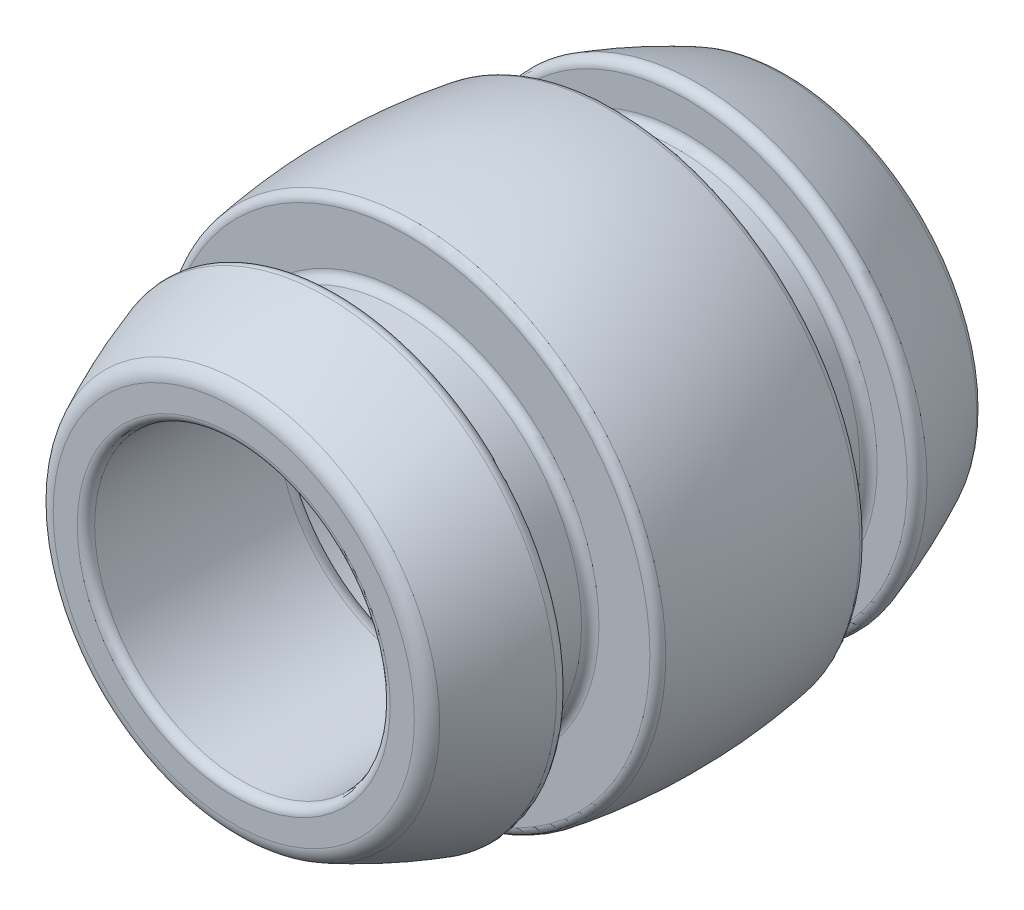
ISO-10303-21;
HEADER;
FILE_DESCRIPTION(('STEP AP214'),'2;1');
FILE_NAME('part.step','',(''),(''),'','','');
FILE_SCHEMA(('AUTOMOTIVE_DESIGN { 1 0 10303 214 1 1 1 1 }'));
ENDSEC;
DATA;
#1=APPLICATION_CONTEXT('core data for automotive mechanical design processes');
#2=APPLICATION_PROTOCOL_DEFINITION('international standard','automotive_design',2000,#1);
#3=PRODUCT_CONTEXT('',#1,'mechanical');
#4=PRODUCT('Part','Part','',(#3));
#5=PRODUCT_RELATED_PRODUCT_CATEGORY('part','',(#4));
#6=PRODUCT_DEFINITION_FORMATION('','',#4);
#7=PRODUCT_DEFINITION_CONTEXT('part definition',#1,'design');
#8=PRODUCT_DEFINITION('design','',#6,#7);
#9=PRODUCT_DEFINITION_SHAPE('','',#8);
#10=(LENGTH_UNIT() NAMED_UNIT(*) SI_UNIT(.MILLI.,.METRE.));
#11=(NAMED_UNIT(*) PLANE_ANGLE_UNIT() SI_UNIT($,.RADIAN.));
#12=(NAMED_UNIT(*) SI_UNIT($,.STERADIAN.) SOLID_ANGLE_UNIT());
#13=UNCERTAINTY_MEASURE_WITH_UNIT(LENGTH_MEASURE(1.E-05),#10,'distance_accuracy_value','');
#14=(GEOMETRIC_REPRESENTATION_CONTEXT(3) GLOBAL_UNCERTAINTY_ASSIGNED_CONTEXT((#13)) GLOBAL_UNIT_ASSIGNED_CONTEXT((#10,
#11,#12)) REPRESENTATION_CONTEXT('',''));
#15=CARTESIAN_POINT('',(0.,0.,0.));
#16=DIRECTION('',(0.,0.,1.));
#17=DIRECTION('',(1.,0.,0.));
#18=AXIS2_PLACEMENT_3D('',#15,#16,#17);
#19=CARTESIAN_POINT('',(0.,0.,-28.5));
#20=DIRECTION('',(0.,0.,1.));
#21=DIRECTION('',(1.,0.,0.));
#22=AXIS2_PLACEMENT_3D('',#19,#20,#21);
#23=PLANE('',#22);
#24=CARTESIAN_POINT('',(0.,0.,-28.5));
#25=DIRECTION('',(0.,0.,-1.));
#26=DIRECTION('',(-1.,0.,0.));
#27=AXIS2_PLACEMENT_3D('',#24,#25,#26);
#28=CIRCLE('',#27,8.);
#29=CARTESIAN_POINT('',(8.,0.,-28.5));
#30=VERTEX_POINT('',#29);
#31=CARTESIAN_POINT('',(-8.,0.,-28.5));
#32=VERTEX_POINT('',#31);
#33=EDGE_CURVE('E132',#30,#32,#28,.F.);
#34=ORIENTED_EDGE('',*,*,#33,.T.);
#35=CARTESIAN_POINT('',(0.,0.,-28.5));
#36=DIRECTION('',(0.,0.,-1.));
#37=DIRECTION('',(1.,0.,0.));
#38=AXIS2_PLACEMENT_3D('',#35,#36,#37);
#39=CIRCLE('',#38,8.);
#40=EDGE_CURVE('E129',#32,#30,#39,.F.);
#41=ORIENTED_EDGE('',*,*,#40,.T.);
#42=EDGE_LOOP('',(#34,#41));
#43=FACE_BOUND('',#42,.T.);
#44=ADVANCED_FACE('F17',(#43),#23,.T.);
#45=CARTESIAN_POINT('',(0.,0.,-28.));
#46=DIRECTION('',(0.,0.,1.));
#47=DIRECTION('',(1.,0.,0.));
#48=AXIS2_PLACEMENT_3D('',#45,#46,#47);
#49=TOROIDAL_SURFACE('',#48,8.,0.5);
#50=ORIENTED_EDGE('',*,*,#33,.F.);
#51=ORIENTED_EDGE('',*,*,#40,.F.);
#52=EDGE_LOOP('',(#50,#51));
#53=FACE_BOUND('',#52,.T.);
#54=CARTESIAN_POINT('',(0.,0.,-28.));
#55=DIRECTION('',(0.,0.,1.));
#56=DIRECTION('',(1.,0.,0.));
#57=AXIS2_PLACEMENT_3D('',#54,#55,#56);
#58=CIRCLE('',#57,8.5);
#59=CARTESIAN_POINT('',(8.5,0.,-28.));
#60=VERTEX_POINT('',#59);
#61=EDGE_CURVE('E136',#60,#60,#58,.T.);
#62=ORIENTED_EDGE('',*,*,#61,.T.);
#63=EDGE_LOOP('',(#62));
#64=FACE_BOUND('',#63,.T.);
#65=ADVANCED_FACE('F139',(#53,#64),#49,.F.);
#66=CARTESIAN_POINT('',(0.,0.,-56.0416305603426));
#67=DIRECTION('',(0.,0.,1.));
#68=DIRECTION('',(1.,0.,0.));
#69=AXIS2_PLACEMENT_3D('',#66,#67,#68);
#70=CYLINDRICAL_SURFACE('',#69,8.5);
#71=ORIENTED_EDGE('',*,*,#61,.F.);
#72=EDGE_LOOP('',(#71));
#73=FACE_BOUND('',#72,.T.);
#74=CARTESIAN_POINT('',(0.,0.,-21.));
#75=DIRECTION('',(0.,0.,1.));
#76=DIRECTION('',(1.,0.,0.));
#77=AXIS2_PLACEMENT_3D('',#74,#75,#76);
#78=CIRCLE('',#77,8.5);
#79=CARTESIAN_POINT('',(8.5,0.,-21.));
#80=VERTEX_POINT('',#79);
#81=EDGE_CURVE('E178',#80,#80,#78,.F.);
#82=ORIENTED_EDGE('',*,*,#81,.F.);
#83=EDGE_LOOP('',(#82));
#84=FACE_BOUND('',#83,.T.);
#85=ADVANCED_FACE('F159',(#73,#84),#70,.F.);
#86=CARTESIAN_POINT('',(0.,0.,-21.));
#87=DIRECTION('',(0.,0.,1.));
#88=DIRECTION('',(1.,0.,0.));
#89=AXIS2_PLACEMENT_3D('',#86,#87,#88);
#90=TOROIDAL_SURFACE('',#89,9.5,1.);
#91=ORIENTED_EDGE('',*,*,#81,.T.);
#92=EDGE_LOOP('',(#91));
#93=FACE_BOUND('',#92,.T.);
#94=CARTESIAN_POINT('',(0.,0.,-20.));
#95=DIRECTION('',(0.,0.,1.));
#96=DIRECTION('',(1.,0.,0.));
#97=AXIS2_PLACEMENT_3D('',#94,#95,#96);
#98=CIRCLE('',#97,9.5);
#99=CARTESIAN_POINT('',(-9.5,0.,-20.));
#100=VERTEX_POINT('',#99);
#101=CARTESIAN_POINT('',(9.5,0.,-20.));
#102=VERTEX_POINT('',#101);
#103=EDGE_CURVE('E173',#100,#102,#98,.F.);
#104=ORIENTED_EDGE('',*,*,#103,.F.);
#105=CARTESIAN_POINT('',(0.,0.,-20.));
#106=DIRECTION('',(0.,0.,1.));
#107=DIRECTION('',(-1.,0.,0.));
#108=AXIS2_PLACEMENT_3D('',#105,#106,#107);
#109=CIRCLE('',#108,9.5);
#110=EDGE_CURVE('E186',#102,#100,#109,.F.);
#111=ORIENTED_EDGE('',*,*,#110,.F.);
#112=EDGE_LOOP('',(#104,#111));
#113=FACE_BOUND('',#112,.T.);
#114=ADVANCED_FACE('F147',(#93,#113),#90,.T.);
#115=CARTESIAN_POINT('',(0.,12.,-20.));
#116=DIRECTION('',(0.,0.,1.));
#117=DIRECTION('',(1.,0.,0.));
#118=AXIS2_PLACEMENT_3D('',#115,#116,#117);
#119=PLANE('',#118);
#120=CARTESIAN_POINT('',(0.,0.,-20.));
#121=DIRECTION('',(0.,0.,-1.));
#122=DIRECTION('',(-1.,0.,0.));
#123=AXIS2_PLACEMENT_3D('',#120,#121,#122);
#124=CIRCLE('',#123,11.);
#125=CARTESIAN_POINT('',(11.,0.,-20.));
#126=VERTEX_POINT('',#125);
#127=CARTESIAN_POINT('',(-11.,0.,-20.));
#128=VERTEX_POINT('',#127);
#129=EDGE_CURVE('E815',#126,#128,#124,.F.);
#130=ORIENTED_EDGE('',*,*,#129,.T.);
#131=CARTESIAN_POINT('',(0.,0.,-20.));
#132=DIRECTION('',(0.,0.,-1.));
#133=DIRECTION('',(1.,0.,0.));
#134=AXIS2_PLACEMENT_3D('',#131,#132,#133);
#135=CIRCLE('',#134,11.);
#136=EDGE_CURVE('E836',#128,#126,#135,.F.);
#137=ORIENTED_EDGE('',*,*,#136,.T.);
#138=EDGE_LOOP('',(#130,#137));
#139=FACE_BOUND('',#138,.T.);
#140=ORIENTED_EDGE('',*,*,#110,.T.);
#141=ORIENTED_EDGE('',*,*,#103,.T.);
#142=EDGE_LOOP('',(#140,#141));
#143=FACE_BOUND('',#142,.T.);
#144=ADVANCED_FACE('F158',(#139,#143),#119,.T.);
#145=CARTESIAN_POINT('',(0.,0.,-19.));
#146=DIRECTION('',(0.,0.,1.));
#147=DIRECTION('',(1.,0.,0.));
#148=AXIS2_PLACEMENT_3D('',#145,#146,#147);
#149=TOROIDAL_SURFACE('',#148,11.,1.);
#150=CARTESIAN_POINT('',(0.,0.,-19.));
#151=DIRECTION('',(0.,0.,1.));
#152=DIRECTION('',(1.,0.,0.));
#153=AXIS2_PLACEMENT_3D('',#150,#151,#152);
#154=CIRCLE('',#153,12.);
#155=CARTESIAN_POINT('',(12.,0.,-19.));
#156=VERTEX_POINT('',#155);
#157=EDGE_CURVE('E833',#156,#156,#154,.T.);
#158=ORIENTED_EDGE('',*,*,#157,.T.);
#159=EDGE_LOOP('',(#158));
#160=FACE_BOUND('',#159,.T.);
#161=ORIENTED_EDGE('',*,*,#136,.F.);
#162=ORIENTED_EDGE('',*,*,#129,.F.);
#163=EDGE_LOOP('',(#161,#162));
#164=FACE_BOUND('',#163,.T.);
#165=ADVANCED_FACE('F819',(#160,#164),#149,.F.);
#166=CARTESIAN_POINT('',(0.,0.,10.1838755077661));
#167=DIRECTION('',(0.,0.,1.));
#168=DIRECTION('',(1.,0.,0.));
#169=AXIS2_PLACEMENT_3D('',#166,#167,#168);
#170=CYLINDRICAL_SURFACE('',#169,12.);
#171=CARTESIAN_POINT('',(0.,0.,-13.));
#172=DIRECTION('',(0.,0.,-1.));
#173=DIRECTION('',(-1.,0.,0.));
#174=AXIS2_PLACEMENT_3D('',#171,#172,#173);
#175=CIRCLE('',#174,12.);
#176=CARTESIAN_POINT('',(-12.,0.,-13.));
#177=VERTEX_POINT('',#176);
#178=EDGE_CURVE('E832',#177,#177,#175,.F.);
#179=ORIENTED_EDGE('',*,*,#178,.T.);
#180=EDGE_LOOP('',(#179));
#181=FACE_BOUND('',#180,.T.);
#182=ORIENTED_EDGE('',*,*,#157,.F.);
#183=EDGE_LOOP('',(#182));
#184=FACE_BOUND('',#183,.T.);
#185=ADVANCED_FACE('F799',(#181,#184),#170,.F.);
#186=CARTESIAN_POINT('',(0.,0.,-13.));
#187=DIRECTION('',(0.,0.,-1.));
#188=DIRECTION('',(-1.,0.,0.));
#189=AXIS2_PLACEMENT_3D('',#186,#187,#188);
#190=TOROIDAL_SURFACE('',#189,11.,1.);
#191=ORIENTED_EDGE('',*,*,#178,.F.);
#192=EDGE_LOOP('',(#191));
#193=FACE_BOUND('',#192,.T.);
#194=CARTESIAN_POINT('',(0.,0.,-12.));
#195=DIRECTION('',(0.,0.,1.));
#196=DIRECTION('',(-1.,0.,0.));
#197=AXIS2_PLACEMENT_3D('',#194,#195,#196);
#198=CIRCLE('',#197,11.);
#199=CARTESIAN_POINT('',(11.,0.,-12.));
#200=VERTEX_POINT('',#199);
#201=CARTESIAN_POINT('',(-11.,0.,-12.));
#202=VERTEX_POINT('',#201);
#203=EDGE_CURVE('E755',#200,#202,#198,.F.);
#204=ORIENTED_EDGE('',*,*,#203,.F.);
#205=CARTESIAN_POINT('',(0.,0.,-12.));
#206=DIRECTION('',(0.,0.,1.));
#207=DIRECTION('',(1.,0.,0.));
#208=AXIS2_PLACEMENT_3D('',#205,#206,#207);
#209=CIRCLE('',#208,11.);
#210=EDGE_CURVE('E745',#202,#200,#209,.F.);
#211=ORIENTED_EDGE('',*,*,#210,.F.);
#212=EDGE_LOOP('',(#204,#211));
#213=FACE_BOUND('',#212,.T.);
#214=ADVANCED_FACE('F795',(#193,#213),#190,.F.);
#215=CARTESIAN_POINT('',(0.,12.,-12.));
#216=DIRECTION('',(0.,0.,-1.));
#217=DIRECTION('',(-1.,0.,0.));
#218=AXIS2_PLACEMENT_3D('',#215,#216,#217);
#219=PLANE('',#218);
#220=CARTESIAN_POINT('',(0.,0.,-12.));
#221=DIRECTION('',(0.,0.,-1.));
#222=DIRECTION('',(1.,0.,0.));
#223=AXIS2_PLACEMENT_3D('',#220,#221,#222);
#224=CIRCLE('',#223,9.5);
#225=CARTESIAN_POINT('',(9.5,0.,-12.));
#226=VERTEX_POINT('',#225);
#227=CARTESIAN_POINT('',(-9.5,0.,-12.));
#228=VERTEX_POINT('',#227);
#229=EDGE_CURVE('E716',#226,#228,#224,.T.);
#230=ORIENTED_EDGE('',*,*,#229,.F.);
#231=CARTESIAN_POINT('',(0.,0.,-12.));
#232=DIRECTION('',(0.,0.,-1.));
#233=DIRECTION('',(-1.,0.,0.));
#234=AXIS2_PLACEMENT_3D('',#231,#232,#233);
#235=CIRCLE('',#234,9.5);
#236=EDGE_CURVE('E775',#228,#226,#235,.T.);
#237=ORIENTED_EDGE('',*,*,#236,.F.);
#238=EDGE_LOOP('',(#230,#237));
#239=FACE_BOUND('',#238,.T.);
#240=ORIENTED_EDGE('',*,*,#210,.T.);
#241=ORIENTED_EDGE('',*,*,#203,.T.);
#242=EDGE_LOOP('',(#240,#241));
#243=FACE_BOUND('',#242,.T.);
#244=ADVANCED_FACE('F731',(#239,#243),#219,.T.);
#245=CARTESIAN_POINT('',(0.,0.,-11.));
#246=DIRECTION('',(0.,0.,-1.));
#247=DIRECTION('',(-1.,0.,0.));
#248=AXIS2_PLACEMENT_3D('',#245,#246,#247);
#249=TOROIDAL_SURFACE('',#248,9.5,1.);
#250=CARTESIAN_POINT('',(0.,0.,-11.));
#251=DIRECTION('',(0.,0.,1.));
#252=DIRECTION('',(1.,0.,0.));
#253=AXIS2_PLACEMENT_3D('',#250,#251,#252);
#254=CIRCLE('',#253,8.5);
#255=CARTESIAN_POINT('',(8.5,0.,-11.));
#256=VERTEX_POINT('',#255);
#257=EDGE_CURVE('E740',#256,#256,#254,.T.);
#258=ORIENTED_EDGE('',*,*,#257,.T.);
#259=EDGE_LOOP('',(#258));
#260=FACE_BOUND('',#259,.T.);
#261=ORIENTED_EDGE('',*,*,#236,.T.);
#262=ORIENTED_EDGE('',*,*,#229,.T.);
#263=EDGE_LOOP('',(#261,#262));
#264=FACE_BOUND('',#263,.T.);
#265=ADVANCED_FACE('F721',(#260,#264),#249,.T.);
#266=CARTESIAN_POINT('',(0.,0.,-56.0416305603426));
#267=DIRECTION('',(0.,0.,1.));
#268=DIRECTION('',(1.,0.,0.));
#269=AXIS2_PLACEMENT_3D('',#266,#267,#268);
#270=CYLINDRICAL_SURFACE('',#269,8.5);
#271=ORIENTED_EDGE('',*,*,#257,.F.);
#272=EDGE_LOOP('',(#271));
#273=FACE_BOUND('',#272,.T.);
#274=CARTESIAN_POINT('',(0.,0.,-0.5));
#275=DIRECTION('',(0.,0.,-1.));
#276=DIRECTION('',(-1.,0.,0.));
#277=AXIS2_PLACEMENT_3D('',#274,#275,#276);
#278=CIRCLE('',#277,8.5);
#279=CARTESIAN_POINT('',(-8.5,0.,-0.5));
#280=VERTEX_POINT('',#279);
#281=EDGE_CURVE('E1152',#280,#280,#278,.T.);
#282=ORIENTED_EDGE('',*,*,#281,.F.);
#283=EDGE_LOOP('',(#282));
#284=FACE_BOUND('',#283,.T.);
#285=ADVANCED_FACE('F695',(#273,#284),#270,.F.);
#286=CARTESIAN_POINT('',(0.,0.,-0.5));
#287=DIRECTION('',(0.,0.,-1.));
#288=DIRECTION('',(-1.,0.,0.));
#289=AXIS2_PLACEMENT_3D('',#286,#287,#288);
#290=TOROIDAL_SURFACE('',#289,9.,0.5);
#291=CARTESIAN_POINT('',(0.,0.,0.));
#292=DIRECTION('',(0.,0.,1.));
#293=DIRECTION('',(-1.,0.,0.));
#294=AXIS2_PLACEMENT_3D('',#291,#292,#293);
#295=CIRCLE('',#294,9.);
#296=CARTESIAN_POINT('',(-9.,0.,0.));
#297=VERTEX_POINT('',#296);
#298=CARTESIAN_POINT('',(9.,0.,0.));
#299=VERTEX_POINT('',#298);
#300=EDGE_CURVE('E605',#297,#299,#295,.T.);
#301=ORIENTED_EDGE('',*,*,#300,.T.);
#302=CARTESIAN_POINT('',(0.,0.,0.));
#303=DIRECTION('',(0.,0.,1.));
#304=DIRECTION('',(1.,0.,0.));
#305=AXIS2_PLACEMENT_3D('',#302,#303,#304);
#306=CIRCLE('',#305,9.);
#307=EDGE_CURVE('E1157',#299,#297,#306,.T.);
#308=ORIENTED_EDGE('',*,*,#307,.T.);
#309=EDGE_LOOP('',(#301,#308));
#310=FACE_BOUND('',#309,.T.);
#311=ORIENTED_EDGE('',*,*,#281,.T.);
#312=EDGE_LOOP('',(#311));
#313=FACE_BOUND('',#312,.T.);
#314=ADVANCED_FACE('F691',(#310,#313),#290,.T.);
#315=CARTESIAN_POINT('',(0.,0.,-32.));
#316=DIRECTION('',(0.,0.,1.));
#317=DIRECTION('',(1.,0.,0.));
#318=AXIS2_PLACEMENT_3D('',#315,#316,#317);
#319=PLANE('',#318);
#320=CARTESIAN_POINT('',(0.,0.,-32.));
#321=DIRECTION('',(0.,0.,1.));
#322=DIRECTION('',(1.,0.,0.));
#323=AXIS2_PLACEMENT_3D('',#320,#321,#322);
#324=CIRCLE('',#323,10.383527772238);
#325=CARTESIAN_POINT('',(10.383527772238,0.,-32.));
#326=VERTEX_POINT('',#325);
#327=CARTESIAN_POINT('',(-10.383527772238,0.,-32.));
#328=VERTEX_POINT('',#327);
#329=EDGE_CURVE('E658',#326,#328,#324,.T.);
#330=ORIENTED_EDGE('',*,*,#329,.F.);
#331=CARTESIAN_POINT('',(0.,0.,-32.));
#332=DIRECTION('',(0.,0.,1.));
#333=DIRECTION('',(-1.,0.,0.));
#334=AXIS2_PLACEMENT_3D('',#331,#332,#333);
#335=CIRCLE('',#334,10.383527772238);
#336=EDGE_CURVE('E669',#328,#326,#335,.T.);
#337=ORIENTED_EDGE('',*,*,#336,.F.);
#338=EDGE_LOOP('',(#330,#337));
#339=FACE_BOUND('',#338,.T.);
#340=ADVANCED_FACE('F619',(#339),#319,.F.);
#341=CARTESIAN_POINT('',(0.,0.,0.));
#342=DIRECTION('',(0.,0.,-1.));
#343=DIRECTION('',(-1.,0.,0.));
#344=AXIS2_PLACEMENT_3D('',#341,#342,#343);
#345=PLANE('',#344);
#346=CARTESIAN_POINT('',(0.,0.,0.));
#347=DIRECTION('',(0.,0.,-1.));
#348=DIRECTION('',(-1.,0.,0.));
#349=AXIS2_PLACEMENT_3D('',#346,#347,#348);
#350=CIRCLE('',#349,10.383527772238);
#351=CARTESIAN_POINT('',(-10.383527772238,0.,0.));
#352=VERTEX_POINT('',#351);
#353=CARTESIAN_POINT('',(10.383527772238,0.,0.));
#354=VERTEX_POINT('',#353);
#355=EDGE_CURVE('E563',#352,#354,#350,.T.);
#356=ORIENTED_EDGE('',*,*,#355,.F.);
#357=CARTESIAN_POINT('',(0.,0.,0.));
#358=DIRECTION('',(0.,0.,-1.));
#359=DIRECTION('',(1.,0.,0.));
#360=AXIS2_PLACEMENT_3D('',#357,#358,#359);
#361=CIRCLE('',#360,10.383527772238);
#362=EDGE_CURVE('E598',#354,#352,#361,.T.);
#363=ORIENTED_EDGE('',*,*,#362,.F.);
#364=EDGE_LOOP('',(#356,#363));
#365=FACE_BOUND('',#364,.T.);
#366=ORIENTED_EDGE('',*,*,#300,.F.);
#367=ORIENTED_EDGE('',*,*,#307,.F.);
#368=EDGE_LOOP('',(#366,#367));
#369=FACE_BOUND('',#368,.T.);
#370=ADVANCED_FACE('F610',(#365,#369),#345,.F.);
#371=CARTESIAN_POINT('',(0.,0.,-31.));
#372=DIRECTION('',(0.,0.,1.));
#373=DIRECTION('',(1.,0.,0.));
#374=AXIS2_PLACEMENT_3D('',#371,#372,#373);
#375=TOROIDAL_SURFACE('',#374,10.383527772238,1.);
#376=ORIENTED_EDGE('',*,*,#329,.T.);
#377=ORIENTED_EDGE('',*,*,#336,.T.);
#378=EDGE_LOOP('',(#376,#377));
#379=FACE_BOUND('',#378,.T.);
#380=CARTESIAN_POINT('',(0.,0.,-31.4411764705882));
#381=DIRECTION('',(0.,0.,1.));
#382=DIRECTION('',(1.,0.,0.));
#383=AXIS2_PLACEMENT_3D('',#380,#381,#382);
#384=CIRCLE('',#383,11.2809481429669);
#385=CARTESIAN_POINT('',(11.2809481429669,0.,-31.4411764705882));
#386=VERTEX_POINT('',#385);
#387=EDGE_CURVE('E596',#386,#386,#384,.T.);
#388=ORIENTED_EDGE('',*,*,#387,.F.);
#389=EDGE_LOOP('',(#388));
#390=FACE_BOUND('',#389,.T.);
#391=ADVANCED_FACE('F582',(#379,#390),#375,.T.);
#392=CARTESIAN_POINT('',(0.,0.,-0.999999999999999));
#393=DIRECTION('',(0.,0.,-1.));
#394=DIRECTION('',(-1.,0.,0.));
#395=AXIS2_PLACEMENT_3D('',#392,#393,#394);
#396=TOROIDAL_SURFACE('',#395,10.383527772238,1.);
#397=ORIENTED_EDGE('',*,*,#355,.T.);
#398=ORIENTED_EDGE('',*,*,#362,.T.);
#399=EDGE_LOOP('',(#397,#398));
#400=FACE_BOUND('',#399,.T.);
#401=CARTESIAN_POINT('',(0.,0.,-0.558823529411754));
#402=DIRECTION('',(0.,0.,1.));
#403=DIRECTION('',(1.,0.,0.));
#404=AXIS2_PLACEMENT_3D('',#401,#402,#403);
#405=CIRCLE('',#404,11.2809481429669);
#406=CARTESIAN_POINT('',(11.2809481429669,0.,-0.558823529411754));
#407=VERTEX_POINT('',#406);
#408=EDGE_CURVE('E593',#407,#407,#405,.F.);
#409=ORIENTED_EDGE('',*,*,#408,.F.);
#410=EDGE_LOOP('',(#409));
#411=FACE_BOUND('',#410,.T.);
#412=ADVANCED_FACE('F570',(#400,#411),#396,.T.);
#413=CARTESIAN_POINT('',(-20.1287648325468,0.,-16.));
#414=DIRECTION('',(0.,1.,0.));
#415=DIRECTION('',(1.,0.,0.));
#416=AXIS2_PLACEMENT_3D('',#413,#414,#415);
#417=CIRCLE('',#416,35.);
#418=TRIMMED_CURVE('',#417,(PARAMETER_VALUE(-0.958060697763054)),
(PARAMETER_VALUE(0.958060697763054)),.T.,.PARAMETER.);
#419=CARTESIAN_POINT('',(0.,0.,-16.));
#420=DIRECTION('',(0.,0.,1.));
#421=AXIS1_PLACEMENT('',#419,#420);
#422=SURFACE_OF_REVOLUTION('',#418,#421);
#423=ORIENTED_EDGE('',*,*,#387,.T.);
#424=EDGE_LOOP('',(#423));
#425=FACE_BOUND('',#424,.T.);
#426=CARTESIAN_POINT('',(0.,0.,-26.6521739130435));
#427=DIRECTION('',(0.,0.,-1.));
#428=DIRECTION('',(-1.,0.,0.));
#429=AXIS2_PLACEMENT_3D('',#426,#427,#428);
#430=CIRCLE('',#429,13.2108691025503);
#431=CARTESIAN_POINT('',(-13.2108691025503,0.,-26.6521739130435));
#432=VERTEX_POINT('',#431);
#433=EDGE_CURVE('E592',#432,#432,#430,.F.);
#434=ORIENTED_EDGE('',*,*,#433,.F.);
#435=EDGE_LOOP('',(#434));
#436=FACE_BOUND('',#435,.T.);
#437=ADVANCED_FACE('F581',(#425,#436),#422,.F.);
#438=CARTESIAN_POINT('',(-20.1287648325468,0.,-16.));
#439=DIRECTION('',(0.,1.,0.));
#440=DIRECTION('',(1.,0.,0.));
#441=AXIS2_PLACEMENT_3D('',#438,#439,#440);
#442=CIRCLE('',#441,35.);
#443=TRIMMED_CURVE('',#442,(PARAMETER_VALUE(-0.958060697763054)),
(PARAMETER_VALUE(0.958060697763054)),.T.,.PARAMETER.);
#444=CARTESIAN_POINT('',(0.,0.,-16.));
#445=DIRECTION('',(0.,0.,1.));
#446=AXIS1_PLACEMENT('',#444,#445);
#447=SURFACE_OF_REVOLUTION('',#443,#446);
#448=CARTESIAN_POINT('',(0.,0.,-5.34782608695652));
#449=DIRECTION('',(0.,0.,1.));
#450=DIRECTION('',(1.,0.,0.));
#451=AXIS2_PLACEMENT_3D('',#448,#449,#450);
#452=CIRCLE('',#451,13.2108691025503);
#453=CARTESIAN_POINT('',(13.2108691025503,0.,-5.34782608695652));
#454=VERTEX_POINT('',#453);
#455=EDGE_CURVE('E1164',#454,#454,#452,.F.);
#456=ORIENTED_EDGE('',*,*,#455,.F.);
#457=EDGE_LOOP('',(#456));
#458=FACE_BOUND('',#457,.T.);
#459=ORIENTED_EDGE('',*,*,#408,.T.);
#460=EDGE_LOOP('',(#459));
#461=FACE_BOUND('',#460,.T.);
#462=ADVANCED_FACE('F1015',(#458,#461),#447,.F.);
#463=CARTESIAN_POINT('',(0.,0.,-26.5));
#464=DIRECTION('',(0.,0.,-1.));
#465=DIRECTION('',(-1.,0.,0.));
#466=AXIS2_PLACEMENT_3D('',#463,#464,#465);
#467=TOROIDAL_SURFACE('',#466,12.7345886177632,0.5);
#468=CARTESIAN_POINT('',(0.,0.,-26.));
#469=DIRECTION('',(0.,0.,-1.));
#470=DIRECTION('',(-1.,0.,0.));
#471=AXIS2_PLACEMENT_3D('',#468,#469,#470);
#472=CIRCLE('',#471,12.7345886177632);
#473=CARTESIAN_POINT('',(-12.7345886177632,0.,-26.));
#474=VERTEX_POINT('',#473);
#475=CARTESIAN_POINT('',(12.7345886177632,0.,-26.));
#476=VERTEX_POINT('',#475);
#477=EDGE_CURVE('E474',#474,#476,#472,.T.);
#478=ORIENTED_EDGE('',*,*,#477,.T.);
#479=CARTESIAN_POINT('',(0.,0.,-26.));
#480=DIRECTION('',(0.,0.,-1.));
#481=DIRECTION('',(1.,0.,0.));
#482=AXIS2_PLACEMENT_3D('',#479,#480,#481);
#483=CIRCLE('',#482,12.7345886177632);
#484=EDGE_CURVE('E484',#476,#474,#483,.T.);
#485=ORIENTED_EDGE('',*,*,#484,.T.);
#486=EDGE_LOOP('',(#478,#485));
#487=FACE_BOUND('',#486,.T.);
#488=ORIENTED_EDGE('',*,*,#433,.T.);
#489=EDGE_LOOP('',(#488));
#490=FACE_BOUND('',#489,.T.);
#491=ADVANCED_FACE('F532',(#487,#490),#467,.T.);
#492=CARTESIAN_POINT('',(0.,0.,-5.5));
#493=DIRECTION('',(0.,0.,1.));
#494=DIRECTION('',(1.,0.,0.));
#495=AXIS2_PLACEMENT_3D('',#492,#493,#494);
#496=TOROIDAL_SURFACE('',#495,12.7345886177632,0.5);
#497=CARTESIAN_POINT('',(0.,0.,-6.));
#498=DIRECTION('',(0.,0.,1.));
#499=DIRECTION('',(1.,0.,0.));
#500=AXIS2_PLACEMENT_3D('',#497,#498,#499);
#501=CIRCLE('',#500,12.7345886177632);
#502=CARTESIAN_POINT('',(12.7345886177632,0.,-6.));
#503=VERTEX_POINT('',#502);
#504=CARTESIAN_POINT('',(-12.7345886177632,0.,-6.));
#505=VERTEX_POINT('',#504);
#506=EDGE_CURVE('E1182',#503,#505,#501,.T.);
#507=ORIENTED_EDGE('',*,*,#506,.T.);
#508=CARTESIAN_POINT('',(0.,0.,-6.));
#509=DIRECTION('',(0.,0.,1.));
#510=DIRECTION('',(-1.,0.,0.));
#511=AXIS2_PLACEMENT_3D('',#508,#509,#510);
#512=CIRCLE('',#511,12.7345886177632);
#513=EDGE_CURVE('E453',#505,#503,#512,.T.);
#514=ORIENTED_EDGE('',*,*,#513,.T.);
#515=EDGE_LOOP('',(#507,#514));
#516=FACE_BOUND('',#515,.T.);
#517=ORIENTED_EDGE('',*,*,#455,.T.);
#518=EDGE_LOOP('',(#517));
#519=FACE_BOUND('',#518,.T.);
#520=ADVANCED_FACE('F528',(#516,#519),#496,.T.);
#521=CARTESIAN_POINT('',(10.5,0.,-26.));
#522=DIRECTION('',(0.,0.,-1.));
#523=DIRECTION('',(-1.,0.,0.));
#524=AXIS2_PLACEMENT_3D('',#521,#522,#523);
#525=PLANE('',#524);
#526=CARTESIAN_POINT('',(0.,0.,-26.));
#527=DIRECTION('',(0.,0.,1.));
#528=DIRECTION('',(-1.,0.,0.));
#529=AXIS2_PLACEMENT_3D('',#526,#527,#528);
#530=CIRCLE('',#529,11.);
#531=CARTESIAN_POINT('',(11.,0.,-26.));
#532=VERTEX_POINT('',#531);
#533=CARTESIAN_POINT('',(-11.,0.,-26.));
#534=VERTEX_POINT('',#533);
#535=EDGE_CURVE('E495',#532,#534,#530,.F.);
#536=ORIENTED_EDGE('',*,*,#535,.T.);
#537=CARTESIAN_POINT('',(0.,0.,-26.));
#538=DIRECTION('',(0.,0.,1.));
#539=DIRECTION('',(1.,0.,0.));
#540=AXIS2_PLACEMENT_3D('',#537,#538,#539);
#541=CIRCLE('',#540,11.);
#542=EDGE_CURVE('E506',#534,#532,#541,.F.);
#543=ORIENTED_EDGE('',*,*,#542,.T.);
#544=EDGE_LOOP('',(#536,#543));
#545=FACE_BOUND('',#544,.T.);
#546=ORIENTED_EDGE('',*,*,#477,.F.);
#547=ORIENTED_EDGE('',*,*,#484,.F.);
#548=EDGE_LOOP('',(#546,#547));
#549=FACE_BOUND('',#548,.T.);
#550=ADVANCED_FACE('F431',(#545,#549),#525,.F.);
#551=CARTESIAN_POINT('',(10.5,0.,-6.));
#552=DIRECTION('',(0.,0.,1.));
#553=DIRECTION('',(1.,0.,0.));
#554=AXIS2_PLACEMENT_3D('',#551,#552,#553);
#555=PLANE('',#554);
#556=ORIENTED_EDGE('',*,*,#506,.F.);
#557=ORIENTED_EDGE('',*,*,#513,.F.);
#558=EDGE_LOOP('',(#556,#557));
#559=FACE_BOUND('',#558,.T.);
#560=CARTESIAN_POINT('',(0.,0.,-6.));
#561=DIRECTION('',(0.,0.,-1.));
#562=DIRECTION('',(1.,0.,0.));
#563=AXIS2_PLACEMENT_3D('',#560,#561,#562);
#564=CIRCLE('',#563,11.);
#565=CARTESIAN_POINT('',(-11.,0.,-6.));
#566=VERTEX_POINT('',#565);
#567=CARTESIAN_POINT('',(11.,0.,-6.));
#568=VERTEX_POINT('',#567);
#569=EDGE_CURVE('E381',#566,#568,#564,.F.);
#570=ORIENTED_EDGE('',*,*,#569,.T.);
#571=CARTESIAN_POINT('',(0.,0.,-6.));
#572=DIRECTION('',(0.,0.,-1.));
#573=DIRECTION('',(-1.,0.,0.));
#574=AXIS2_PLACEMENT_3D('',#571,#572,#573);
#575=CIRCLE('',#574,11.);
#576=EDGE_CURVE('E413',#568,#566,#575,.F.);
#577=ORIENTED_EDGE('',*,*,#576,.T.);
#578=EDGE_LOOP('',(#570,#577));
#579=FACE_BOUND('',#578,.T.);
#580=ADVANCED_FACE('F422',(#559,#579),#555,.F.);
#581=CARTESIAN_POINT('',(0.,0.,-25.5));
#582=DIRECTION('',(0.,0.,-1.));
#583=DIRECTION('',(-1.,0.,0.));
#584=AXIS2_PLACEMENT_3D('',#581,#582,#583);
#585=TOROIDAL_SURFACE('',#584,11.,0.5);
#586=ORIENTED_EDGE('',*,*,#542,.F.);
#587=ORIENTED_EDGE('',*,*,#535,.F.);
#588=EDGE_LOOP('',(#586,#587));
#589=FACE_BOUND('',#588,.T.);
#590=CARTESIAN_POINT('',(0.,0.,-25.5));
#591=DIRECTION('',(0.,0.,1.));
#592=DIRECTION('',(1.,0.,0.));
#593=AXIS2_PLACEMENT_3D('',#590,#591,#592);
#594=CIRCLE('',#593,10.5);
#595=CARTESIAN_POINT('',(10.5,0.,-25.5));
#596=VERTEX_POINT('',#595);
#597=EDGE_CURVE('E411',#596,#596,#594,.T.);
#598=ORIENTED_EDGE('',*,*,#597,.F.);
#599=EDGE_LOOP('',(#598));
#600=FACE_BOUND('',#599,.T.);
#601=ADVANCED_FACE('F400',(#589,#600),#585,.F.);
#602=CARTESIAN_POINT('',(0.,0.,-6.5));
#603=DIRECTION('',(0.,0.,1.));
#604=DIRECTION('',(1.,0.,0.));
#605=AXIS2_PLACEMENT_3D('',#602,#603,#604);
#606=TOROIDAL_SURFACE('',#605,11.,0.5);
#607=ORIENTED_EDGE('',*,*,#576,.F.);
#608=ORIENTED_EDGE('',*,*,#569,.F.);
#609=EDGE_LOOP('',(#607,#608));
#610=FACE_BOUND('',#609,.T.);
#611=CARTESIAN_POINT('',(0.,0.,-6.5));
#612=DIRECTION('',(0.,0.,1.));
#613=DIRECTION('',(1.,0.,0.));
#614=AXIS2_PLACEMENT_3D('',#611,#612,#613);
#615=CIRCLE('',#614,10.5);
#616=CARTESIAN_POINT('',(10.5,0.,-6.5));
#617=VERTEX_POINT('',#616);
#618=EDGE_CURVE('E409',#617,#617,#615,.F.);
#619=ORIENTED_EDGE('',*,*,#618,.F.);
#620=EDGE_LOOP('',(#619));
#621=FACE_BOUND('',#620,.T.);
#622=ADVANCED_FACE('F388',(#610,#621),#606,.F.);
#623=CARTESIAN_POINT('',(0.,0.,0.));
#624=DIRECTION('',(0.,0.,1.));
#625=DIRECTION('',(1.,0.,0.));
#626=AXIS2_PLACEMENT_3D('',#623,#624,#625);
#627=CYLINDRICAL_SURFACE('',#626,10.5);
#628=CARTESIAN_POINT('',(0.,0.,-22.5));
#629=DIRECTION('',(0.,0.,1.));
#630=DIRECTION('',(1.,0.,0.));
#631=AXIS2_PLACEMENT_3D('',#628,#629,#630);
#632=CIRCLE('',#631,10.5);
#633=CARTESIAN_POINT('',(10.5,0.,-22.5));
#634=VERTEX_POINT('',#633);
#635=EDGE_CURVE('E891',#634,#634,#632,.F.);
#636=ORIENTED_EDGE('',*,*,#635,.T.);
#637=EDGE_LOOP('',(#636));
#638=FACE_BOUND('',#637,.T.);
#639=ORIENTED_EDGE('',*,*,#597,.T.);
#640=EDGE_LOOP('',(#639));
#641=FACE_BOUND('',#640,.T.);
#642=ADVANCED_FACE('F399',(#638,#641),#627,.T.);
#643=CARTESIAN_POINT('',(0.,0.,0.));
#644=DIRECTION('',(0.,0.,1.));
#645=DIRECTION('',(1.,0.,0.));
#646=AXIS2_PLACEMENT_3D('',#643,#644,#645);
#647=CYLINDRICAL_SURFACE('',#646,10.5);
#648=ORIENTED_EDGE('',*,*,#618,.T.);
#649=EDGE_LOOP('',(#648));
#650=FACE_BOUND('',#649,.T.);
#651=CARTESIAN_POINT('',(0.,0.,-9.5));
#652=DIRECTION('',(0.,0.,-1.));
#653=DIRECTION('',(-1.,0.,0.));
#654=AXIS2_PLACEMENT_3D('',#651,#652,#653);
#655=CIRCLE('',#654,10.5);
#656=CARTESIAN_POINT('',(-10.5,0.,-9.5));
#657=VERTEX_POINT('',#656);
#658=EDGE_CURVE('E889',#657,#657,#655,.F.);
#659=ORIENTED_EDGE('',*,*,#658,.T.);
#660=EDGE_LOOP('',(#659));
#661=FACE_BOUND('',#660,.T.);
#662=ADVANCED_FACE('F910',(#650,#661),#647,.T.);
#663=CARTESIAN_POINT('',(0.,0.,-22.5));
#664=DIRECTION('',(0.,0.,1.));
#665=DIRECTION('',(1.,0.,0.));
#666=AXIS2_PLACEMENT_3D('',#663,#664,#665);
#667=TOROIDAL_SURFACE('',#666,11.,0.5);
#668=CARTESIAN_POINT('',(0.,0.,-22.));
#669=DIRECTION('',(0.,0.,-1.));
#670=DIRECTION('',(-1.,0.,0.));
#671=AXIS2_PLACEMENT_3D('',#668,#669,#670);
#672=CIRCLE('',#671,11.);
#673=CARTESIAN_POINT('',(-11.,0.,-22.));
#674=VERTEX_POINT('',#673);
#675=CARTESIAN_POINT('',(11.,0.,-22.));
#676=VERTEX_POINT('',#675);
#677=EDGE_CURVE('E301',#674,#676,#672,.T.);
#678=ORIENTED_EDGE('',*,*,#677,.T.);
#679=CARTESIAN_POINT('',(0.,0.,-22.));
#680=DIRECTION('',(0.,0.,-1.));
#681=DIRECTION('',(1.,0.,0.));
#682=AXIS2_PLACEMENT_3D('',#679,#680,#681);
#683=CIRCLE('',#682,11.);
#684=EDGE_CURVE('E291',#676,#674,#683,.T.);
#685=ORIENTED_EDGE('',*,*,#684,.T.);
#686=EDGE_LOOP('',(#678,#685));
#687=FACE_BOUND('',#686,.T.);
#688=ORIENTED_EDGE('',*,*,#635,.F.);
#689=EDGE_LOOP('',(#688));
#690=FACE_BOUND('',#689,.T.);
#691=ADVANCED_FACE('F349',(#687,#690),#667,.F.);
#692=CARTESIAN_POINT('',(0.,0.,-9.5));
#693=DIRECTION('',(0.,0.,-1.));
#694=DIRECTION('',(-1.,0.,0.));
#695=AXIS2_PLACEMENT_3D('',#692,#693,#694);
#696=TOROIDAL_SURFACE('',#695,11.,0.5);
#697=CARTESIAN_POINT('',(0.,0.,-10.));
#698=DIRECTION('',(0.,0.,1.));
#699=DIRECTION('',(1.,0.,0.));
#700=AXIS2_PLACEMENT_3D('',#697,#698,#699);
#701=CIRCLE('',#700,11.);
#702=CARTESIAN_POINT('',(11.,0.,-10.));
#703=VERTEX_POINT('',#702);
#704=CARTESIAN_POINT('',(-11.,0.,-10.));
#705=VERTEX_POINT('',#704);
#706=EDGE_CURVE('E270',#703,#705,#701,.T.);
#707=ORIENTED_EDGE('',*,*,#706,.T.);
#708=CARTESIAN_POINT('',(0.,0.,-10.));
#709=DIRECTION('',(0.,0.,1.));
#710=DIRECTION('',(-1.,0.,0.));
#711=AXIS2_PLACEMENT_3D('',#708,#709,#710);
#712=CIRCLE('',#711,11.);
#713=EDGE_CURVE('E887',#705,#703,#712,.T.);
#714=ORIENTED_EDGE('',*,*,#713,.T.);
#715=EDGE_LOOP('',(#707,#714));
#716=FACE_BOUND('',#715,.T.);
#717=ORIENTED_EDGE('',*,*,#658,.F.);
#718=EDGE_LOOP('',(#717));
#719=FACE_BOUND('',#718,.T.);
#720=ADVANCED_FACE('F345',(#716,#719),#696,.F.);
#721=CARTESIAN_POINT('',(10.5,0.,-22.));
#722=DIRECTION('',(0.,0.,1.));
#723=DIRECTION('',(1.,0.,0.));
#724=AXIS2_PLACEMENT_3D('',#721,#722,#723);
#725=PLANE('',#724);
#726=CARTESIAN_POINT('',(0.,0.,-22.));
#727=DIRECTION('',(0.,0.,1.));
#728=DIRECTION('',(1.,0.,0.));
#729=AXIS2_PLACEMENT_3D('',#726,#727,#728);
#730=CIRCLE('',#729,13.930007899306);
#731=CARTESIAN_POINT('',(13.930007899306,0.,-22.));
#732=VERTEX_POINT('',#731);
#733=CARTESIAN_POINT('',(-13.930007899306,0.,-22.));
#734=VERTEX_POINT('',#733);
#735=EDGE_CURVE('E313',#732,#734,#730,.T.);
#736=ORIENTED_EDGE('',*,*,#735,.F.);
#737=CARTESIAN_POINT('',(0.,0.,-22.));
#738=DIRECTION('',(0.,0.,1.));
#739=DIRECTION('',(-1.,0.,0.));
#740=AXIS2_PLACEMENT_3D('',#737,#738,#739);
#741=CIRCLE('',#740,13.930007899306);
#742=EDGE_CURVE('E323',#734,#732,#741,.T.);
#743=ORIENTED_EDGE('',*,*,#742,.F.);
#744=EDGE_LOOP('',(#736,#743));
#745=FACE_BOUND('',#744,.T.);
#746=ORIENTED_EDGE('',*,*,#684,.F.);
#747=ORIENTED_EDGE('',*,*,#677,.F.);
#748=EDGE_LOOP('',(#746,#747));
#749=FACE_BOUND('',#748,.T.);
#750=ADVANCED_FACE('F248',(#745,#749),#725,.F.);
#751=CARTESIAN_POINT('',(10.5,0.,-10.));
#752=DIRECTION('',(0.,0.,-1.));
#753=DIRECTION('',(-1.,0.,0.));
#754=AXIS2_PLACEMENT_3D('',#751,#752,#753);
#755=PLANE('',#754);
#756=ORIENTED_EDGE('',*,*,#713,.F.);
#757=ORIENTED_EDGE('',*,*,#706,.F.);
#758=EDGE_LOOP('',(#756,#757));
#759=FACE_BOUND('',#758,.T.);
#760=CARTESIAN_POINT('',(0.,0.,-10.));
#761=DIRECTION('',(0.,0.,-1.));
#762=DIRECTION('',(-1.,0.,0.));
#763=AXIS2_PLACEMENT_3D('',#760,#761,#762);
#764=CIRCLE('',#763,13.930007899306);
#765=CARTESIAN_POINT('',(-13.930007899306,0.,-10.));
#766=VERTEX_POINT('',#765);
#767=CARTESIAN_POINT('',(13.930007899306,0.,-10.));
#768=VERTEX_POINT('',#767);
#769=EDGE_CURVE('E235',#766,#768,#764,.T.);
#770=ORIENTED_EDGE('',*,*,#769,.F.);
#771=CARTESIAN_POINT('',(0.,0.,-10.));
#772=DIRECTION('',(0.,0.,-1.));
#773=DIRECTION('',(1.,0.,0.));
#774=AXIS2_PLACEMENT_3D('',#771,#772,#773);
#775=CIRCLE('',#774,13.930007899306);
#776=EDGE_CURVE('E36',#768,#766,#775,.T.);
#777=ORIENTED_EDGE('',*,*,#776,.F.);
#778=EDGE_LOOP('',(#770,#777));
#779=FACE_BOUND('',#778,.T.);
#780=ADVANCED_FACE('F239',(#759,#779),#755,.F.);
#781=CARTESIAN_POINT('',(0.,0.,-21.5));
#782=DIRECTION('',(0.,0.,1.));
#783=DIRECTION('',(1.,0.,0.));
#784=AXIS2_PLACEMENT_3D('',#781,#782,#783);
#785=TOROIDAL_SURFACE('',#784,13.930007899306,0.5);
#786=CARTESIAN_POINT('',(0.,0.,-21.5797101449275));
#787=DIRECTION('',(0.,0.,1.));
#788=DIRECTION('',(1.,0.,0.));
#789=AXIS2_PLACEMENT_3D('',#786,#787,#788);
#790=CIRCLE('',#789,14.423613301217);
#791=CARTESIAN_POINT('',(14.423613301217,0.,-21.5797101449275));
#792=VERTEX_POINT('',#791);
#793=EDGE_CURVE('E28',#792,#792,#790,.T.);
#794=ORIENTED_EDGE('',*,*,#793,.F.);
#795=EDGE_LOOP('',(#794));
#796=FACE_BOUND('',#795,.T.);
#797=ORIENTED_EDGE('',*,*,#735,.T.);
#798=ORIENTED_EDGE('',*,*,#742,.T.);
#799=EDGE_LOOP('',(#797,#798));
#800=FACE_BOUND('',#799,.T.);
#801=ADVANCED_FACE('F222',(#796,#800),#785,.T.);
#802=CARTESIAN_POINT('',(0.,0.,-10.5));
#803=DIRECTION('',(0.,0.,-1.));
#804=DIRECTION('',(-1.,0.,0.));
#805=AXIS2_PLACEMENT_3D('',#802,#803,#804);
#806=TOROIDAL_SURFACE('',#805,13.930007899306,0.5);
#807=CARTESIAN_POINT('',(0.,0.,-10.4202898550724));
#808=DIRECTION('',(0.,0.,1.));
#809=DIRECTION('',(1.,0.,0.));
#810=AXIS2_PLACEMENT_3D('',#807,#808,#809);
#811=CIRCLE('',#810,14.4236133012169);
#812=CARTESIAN_POINT('',(14.4236133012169,0.,-10.4202898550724));
#813=VERTEX_POINT('',#812);
#814=EDGE_CURVE('E11',#813,#813,#811,.F.);
#815=ORIENTED_EDGE('',*,*,#814,.F.);
#816=EDGE_LOOP('',(#815));
#817=FACE_BOUND('',#816,.T.);
#818=ORIENTED_EDGE('',*,*,#769,.T.);
#819=ORIENTED_EDGE('',*,*,#776,.T.);
#820=EDGE_LOOP('',(#818,#819));
#821=FACE_BOUND('',#820,.T.);
#822=ADVANCED_FACE('F210',(#817,#821),#806,.T.);
#823=CARTESIAN_POINT('',(-20.1287648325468,0.,-16.));
#824=DIRECTION('',(0.,1.,0.));
#825=DIRECTION('',(1.,0.,0.));
#826=AXIS2_PLACEMENT_3D('',#823,#824,#825);
#827=CIRCLE('',#826,35.);
#828=TRIMMED_CURVE('',#827,(PARAMETER_VALUE(-0.958060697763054)),
(PARAMETER_VALUE(0.958060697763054)),.T.,.PARAMETER.);
#829=CARTESIAN_POINT('',(0.,0.,-16.));
#830=DIRECTION('',(0.,0.,1.));
#831=AXIS1_PLACEMENT('',#829,#830);
#832=SURFACE_OF_REVOLUTION('',#828,#831);
#833=ORIENTED_EDGE('',*,*,#814,.T.);
#834=EDGE_LOOP('',(#833));
#835=FACE_BOUND('',#834,.T.);
#836=ORIENTED_EDGE('',*,*,#793,.T.);
#837=EDGE_LOOP('',(#836));
#838=FACE_BOUND('',#837,.T.);
#839=ADVANCED_FACE('F221',(#835,#838),#832,.F.);
#840=CLOSED_SHELL('',(#44,#65,#85,#114,#144,#165,#185,#214,#244,#265,#285,#314,#340,#370,#391,
#412,#437,#462,#491,#520,#550,#580,#601,#622,#642,#662,#691,#720,#750,#780,#801,#822,#839));
#841=MANIFOLD_SOLID_BREP('B1',#840);
#842=ADVANCED_BREP_SHAPE_REPRESENTATION('',(#18,#841),#14);
#843=SHAPE_DEFINITION_REPRESENTATION(#9,#842);
ENDSEC;
END-ISO-10303-21;
